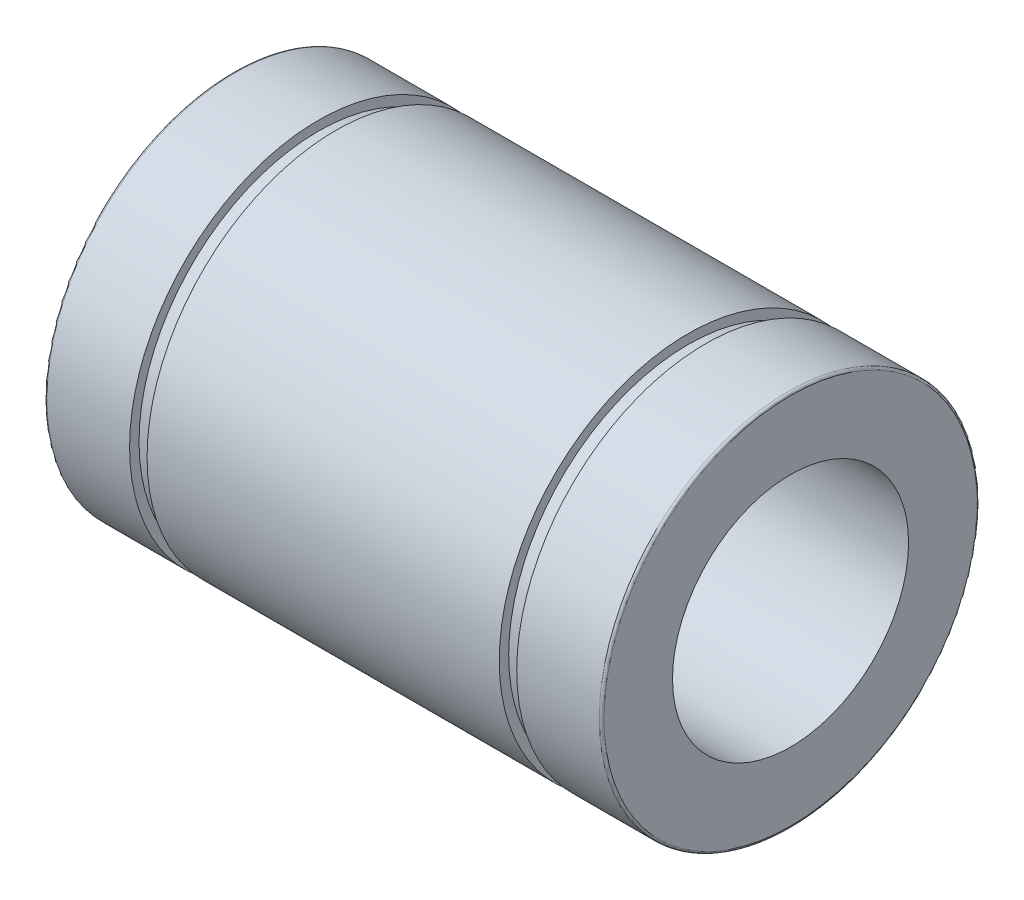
ISO-10303-21;
HEADER;
FILE_DESCRIPTION(('STEP AP214'),'2;1');
FILE_NAME('part.step','',(''),(''),'','','');
FILE_SCHEMA(('AUTOMOTIVE_DESIGN { 1 0 10303 214 1 1 1 1 }'));
ENDSEC;
DATA;
#1=APPLICATION_CONTEXT('core data for automotive mechanical design processes');
#2=APPLICATION_PROTOCOL_DEFINITION('international standard','automotive_design',2000,#1);
#3=PRODUCT_CONTEXT('',#1,'mechanical');
#4=PRODUCT('Part','Part','',(#3));
#5=PRODUCT_RELATED_PRODUCT_CATEGORY('part','',(#4));
#6=PRODUCT_DEFINITION_FORMATION('','',#4);
#7=PRODUCT_DEFINITION_CONTEXT('part definition',#1,'design');
#8=PRODUCT_DEFINITION('design','',#6,#7);
#9=PRODUCT_DEFINITION_SHAPE('','',#8);
#10=(LENGTH_UNIT() NAMED_UNIT(*) SI_UNIT(.MILLI.,.METRE.));
#11=(NAMED_UNIT(*) PLANE_ANGLE_UNIT() SI_UNIT($,.RADIAN.));
#12=(NAMED_UNIT(*) SI_UNIT($,.STERADIAN.) SOLID_ANGLE_UNIT());
#13=UNCERTAINTY_MEASURE_WITH_UNIT(LENGTH_MEASURE(1.E-05),#10,'distance_accuracy_value','');
#14=(GEOMETRIC_REPRESENTATION_CONTEXT(3) GLOBAL_UNCERTAINTY_ASSIGNED_CONTEXT((#13)) GLOBAL_UNIT_ASSIGNED_CONTEXT((#10,
#11,#12)) REPRESENTATION_CONTEXT('',''));
#15=CARTESIAN_POINT('',(0.,0.,0.));
#16=DIRECTION('',(0.,0.,1.));
#17=DIRECTION('',(1.,0.,0.));
#18=AXIS2_PLACEMENT_3D('',#15,#16,#17);
#19=CARTESIAN_POINT('',(-29.25,0.,0.));
#20=DIRECTION('',(1.,0.,0.));
#21=DIRECTION('',(0.,0.,-1.));
#22=AXIS2_PLACEMENT_3D('',#19,#20,#21);
#23=TOROIDAL_SURFACE('',#22,19.75,0.25);
#24=CARTESIAN_POINT('',(-29.25,0.,0.));
#25=DIRECTION('',(1.,0.,0.));
#26=DIRECTION('',(0.,0.,-1.));
#27=AXIS2_PLACEMENT_3D('',#24,#25,#26);
#28=CIRCLE('',#27,20.);
#29=CARTESIAN_POINT('',(-29.25,0.,-20.));
#30=VERTEX_POINT('',#29);
#31=CARTESIAN_POINT('',(-29.25,0.,20.));
#32=VERTEX_POINT('',#31);
#33=EDGE_CURVE('E250',#30,#32,#28,.T.);
#34=ORIENTED_EDGE('',*,*,#33,.F.);
#35=CARTESIAN_POINT('',(-29.25,0.,0.));
#36=DIRECTION('',(1.,0.,0.));
#37=DIRECTION('',(0.,0.,-1.));
#38=AXIS2_PLACEMENT_3D('',#35,#36,#37);
#39=CIRCLE('',#38,20.);
#40=EDGE_CURVE('E252',#32,#30,#39,.T.);
#41=ORIENTED_EDGE('',*,*,#40,.F.);
#42=CARTESIAN_POINT('',(-29.25,0.,19.75));
#43=DIRECTION('',(0.,-1.,0.));
#44=DIRECTION('',(0.,0.,1.));
#45=AXIS2_PLACEMENT_3D('',#42,#43,#44);
#46=CIRCLE('',#45,0.25);
#47=CARTESIAN_POINT('',(-29.5,0.,19.75));
#48=VERTEX_POINT('',#47);
#49=EDGE_CURVE('E10',#32,#48,#46,.T.);
#50=ORIENTED_EDGE('',*,*,#49,.T.);
#51=CARTESIAN_POINT('',(-29.5,0.,0.));
#52=DIRECTION('',(-1.,0.,0.));
#53=DIRECTION('',(0.,0.,-1.));
#54=AXIS2_PLACEMENT_3D('',#51,#52,#53);
#55=CIRCLE('',#54,19.75);
#56=CARTESIAN_POINT('',(-29.5,0.,-19.75));
#57=VERTEX_POINT('',#56);
#58=EDGE_CURVE('E213',#57,#48,#55,.T.);
#59=ORIENTED_EDGE('',*,*,#58,.F.);
#60=CARTESIAN_POINT('',(-29.5,0.,0.));
#61=DIRECTION('',(-1.,0.,0.));
#62=DIRECTION('',(0.,0.,-1.));
#63=AXIS2_PLACEMENT_3D('',#60,#61,#62);
#64=CIRCLE('',#63,19.75);
#65=EDGE_CURVE('E42',#48,#57,#64,.T.);
#66=ORIENTED_EDGE('',*,*,#65,.F.);
#67=ORIENTED_EDGE('',*,*,#49,.F.);
#68=EDGE_LOOP('',(#34,#41,#50,#59,#66,#67));
#69=FACE_BOUND('',#68,.T.);
#70=ADVANCED_FACE('F16',(#69),#23,.T.);
#71=CARTESIAN_POINT('',(29.25,0.,0.));
#72=DIRECTION('',(-1.,0.,0.));
#73=DIRECTION('',(0.,0.,1.));
#74=AXIS2_PLACEMENT_3D('',#71,#72,#73);
#75=TOROIDAL_SURFACE('',#74,19.75,0.25);
#76=CARTESIAN_POINT('',(29.25,0.,0.));
#77=DIRECTION('',(-1.,0.,0.));
#78=DIRECTION('',(0.,0.,1.));
#79=AXIS2_PLACEMENT_3D('',#76,#77,#78);
#80=CIRCLE('',#79,20.);
#81=CARTESIAN_POINT('',(29.25,0.,20.));
#82=VERTEX_POINT('',#81);
#83=CARTESIAN_POINT('',(29.25,0.,-20.));
#84=VERTEX_POINT('',#83);
#85=EDGE_CURVE('E197',#82,#84,#80,.T.);
#86=ORIENTED_EDGE('',*,*,#85,.F.);
#87=CARTESIAN_POINT('',(29.25,0.,0.));
#88=DIRECTION('',(-1.,0.,0.));
#89=DIRECTION('',(0.,0.,1.));
#90=AXIS2_PLACEMENT_3D('',#87,#88,#89);
#91=CIRCLE('',#90,20.);
#92=EDGE_CURVE('E193',#84,#82,#91,.T.);
#93=ORIENTED_EDGE('',*,*,#92,.F.);
#94=CARTESIAN_POINT('',(29.25,0.,-19.75));
#95=DIRECTION('',(0.,-1.,0.));
#96=DIRECTION('',(0.,0.,-1.));
#97=AXIS2_PLACEMENT_3D('',#94,#95,#96);
#98=CIRCLE('',#97,0.25);
#99=CARTESIAN_POINT('',(29.5,0.,-19.75));
#100=VERTEX_POINT('',#99);
#101=EDGE_CURVE('E24',#84,#100,#98,.T.);
#102=ORIENTED_EDGE('',*,*,#101,.T.);
#103=CARTESIAN_POINT('',(29.5,0.,0.));
#104=DIRECTION('',(1.,0.,0.));
#105=DIRECTION('',(0.,0.,1.));
#106=AXIS2_PLACEMENT_3D('',#103,#104,#105);
#107=CIRCLE('',#106,19.75);
#108=CARTESIAN_POINT('',(29.5,0.,19.75));
#109=VERTEX_POINT('',#108);
#110=EDGE_CURVE('E176',#109,#100,#107,.T.);
#111=ORIENTED_EDGE('',*,*,#110,.F.);
#112=CARTESIAN_POINT('',(29.5,0.,0.));
#113=DIRECTION('',(1.,0.,0.));
#114=DIRECTION('',(0.,0.,1.));
#115=AXIS2_PLACEMENT_3D('',#112,#113,#114);
#116=CIRCLE('',#115,19.75);
#117=EDGE_CURVE('E172',#100,#109,#116,.T.);
#118=ORIENTED_EDGE('',*,*,#117,.F.);
#119=ORIENTED_EDGE('',*,*,#101,.F.);
#120=EDGE_LOOP('',(#86,#93,#102,#111,#118,#119));
#121=FACE_BOUND('',#120,.T.);
#122=ADVANCED_FACE('F224',(#121),#75,.T.);
#123=CARTESIAN_POINT('',(-29.5,12.5,0.));
#124=DIRECTION('',(1.,0.,0.));
#125=DIRECTION('',(0.,1.,0.));
#126=AXIS2_PLACEMENT_3D('',#123,#124,#125);
#127=PLANE('',#126);
#128=CARTESIAN_POINT('',(-29.5,0.,0.));
#129=DIRECTION('',(-1.,0.,0.));
#130=DIRECTION('',(0.,0.,1.));
#131=AXIS2_PLACEMENT_3D('',#128,#129,#130);
#132=CIRCLE('',#131,12.5);
#133=CARTESIAN_POINT('',(-29.5,0.,12.5));
#134=VERTEX_POINT('',#133);
#135=CARTESIAN_POINT('',(-29.5,0.,-12.5));
#136=VERTEX_POINT('',#135);
#137=EDGE_CURVE('E212',#134,#136,#132,.T.);
#138=ORIENTED_EDGE('',*,*,#137,.F.);
#139=CARTESIAN_POINT('',(-29.5,0.,0.));
#140=DIRECTION('',(-1.,0.,0.));
#141=DIRECTION('',(0.,0.,1.));
#142=AXIS2_PLACEMENT_3D('',#139,#140,#141);
#143=CIRCLE('',#142,12.5);
#144=EDGE_CURVE('E185',#136,#134,#143,.T.);
#145=ORIENTED_EDGE('',*,*,#144,.F.);
#146=EDGE_LOOP('',(#138,#145));
#147=FACE_BOUND('',#146,.T.);
#148=ORIENTED_EDGE('',*,*,#58,.T.);
#149=ORIENTED_EDGE('',*,*,#65,.T.);
#150=EDGE_LOOP('',(#148,#149));
#151=FACE_BOUND('',#150,.T.);
#152=ADVANCED_FACE('F239',(#147,#151),#127,.F.);
#153=CARTESIAN_POINT('',(-70.8336887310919,0.,0.));
#154=DIRECTION('',(-1.,0.,0.));
#155=DIRECTION('',(0.,0.,1.));
#156=AXIS2_PLACEMENT_3D('',#153,#154,#155);
#157=CYLINDRICAL_SURFACE('',#156,12.5);
#158=CARTESIAN_POINT('',(29.5,0.,0.));
#159=DIRECTION('',(-1.,0.,0.));
#160=DIRECTION('',(0.,0.,1.));
#161=AXIS2_PLACEMENT_3D('',#158,#159,#160);
#162=CIRCLE('',#161,12.5);
#163=CARTESIAN_POINT('',(29.5,0.,12.5));
#164=VERTEX_POINT('',#163);
#165=CARTESIAN_POINT('',(29.5,0.,-12.5));
#166=VERTEX_POINT('',#165);
#167=EDGE_CURVE('E175',#164,#166,#162,.T.);
#168=ORIENTED_EDGE('',*,*,#167,.F.);
#169=CARTESIAN_POINT('',(29.5,0.,0.));
#170=DIRECTION('',(-1.,0.,0.));
#171=DIRECTION('',(0.,0.,1.));
#172=AXIS2_PLACEMENT_3D('',#169,#170,#171);
#173=CIRCLE('',#172,12.5);
#174=EDGE_CURVE('E186',#166,#164,#173,.T.);
#175=ORIENTED_EDGE('',*,*,#174,.F.);
#176=DIRECTION('',(-1.,0.,0.));
#177=VECTOR('',#176,1.);
#178=CARTESIAN_POINT('',(-70.8336887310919,0.,-12.5));
#179=LINE('',#178,#177);
#180=EDGE_CURVE('E181',#166,#136,#179,.T.);
#181=ORIENTED_EDGE('',*,*,#180,.T.);
#182=ORIENTED_EDGE('',*,*,#144,.T.);
#183=ORIENTED_EDGE('',*,*,#137,.T.);
#184=ORIENTED_EDGE('',*,*,#180,.F.);
#185=EDGE_LOOP('',(#168,#175,#181,#182,#183,#184));
#186=FACE_BOUND('',#185,.T.);
#187=ADVANCED_FACE('F229',(#186),#157,.F.);
#188=CARTESIAN_POINT('',(29.5,20.,0.));
#189=DIRECTION('',(-1.,0.,0.));
#190=DIRECTION('',(0.,0.,1.));
#191=AXIS2_PLACEMENT_3D('',#188,#189,#190);
#192=PLANE('',#191);
#193=ORIENTED_EDGE('',*,*,#167,.T.);
#194=ORIENTED_EDGE('',*,*,#174,.T.);
#195=EDGE_LOOP('',(#193,#194));
#196=FACE_BOUND('',#195,.T.);
#197=ORIENTED_EDGE('',*,*,#110,.T.);
#198=ORIENTED_EDGE('',*,*,#117,.T.);
#199=EDGE_LOOP('',(#197,#198));
#200=FACE_BOUND('',#199,.T.);
#201=ADVANCED_FACE('F226',(#196,#200),#192,.F.);
#202=CARTESIAN_POINT('',(-70.8336887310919,0.,0.));
#203=DIRECTION('',(-1.,0.,0.));
#204=DIRECTION('',(0.,0.,1.));
#205=AXIS2_PLACEMENT_3D('',#202,#203,#204);
#206=CYLINDRICAL_SURFACE('',#205,20.);
#207=CARTESIAN_POINT('',(20.5,0.,0.));
#208=DIRECTION('',(-1.,0.,0.));
#209=DIRECTION('',(0.,0.,1.));
#210=AXIS2_PLACEMENT_3D('',#207,#208,#209);
#211=CIRCLE('',#210,20.);
#212=CARTESIAN_POINT('',(20.5,0.,20.));
#213=VERTEX_POINT('',#212);
#214=CARTESIAN_POINT('',(20.5,0.,-20.));
#215=VERTEX_POINT('',#214);
#216=EDGE_CURVE('E156',#213,#215,#211,.T.);
#217=ORIENTED_EDGE('',*,*,#216,.F.);
#218=CARTESIAN_POINT('',(20.5,0.,0.));
#219=DIRECTION('',(-1.,0.,0.));
#220=DIRECTION('',(0.,0.,1.));
#221=AXIS2_PLACEMENT_3D('',#218,#219,#220);
#222=CIRCLE('',#221,20.);
#223=EDGE_CURVE('E180',#215,#213,#222,.T.);
#224=ORIENTED_EDGE('',*,*,#223,.F.);
#225=DIRECTION('',(1.,0.,0.));
#226=VECTOR('',#225,1.);
#227=CARTESIAN_POINT('',(-70.8336887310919,0.,-20.));
#228=LINE('',#227,#226);
#229=EDGE_CURVE('E189',#215,#84,#228,.T.);
#230=ORIENTED_EDGE('',*,*,#229,.T.);
#231=ORIENTED_EDGE('',*,*,#92,.T.);
#232=ORIENTED_EDGE('',*,*,#85,.T.);
#233=ORIENTED_EDGE('',*,*,#229,.F.);
#234=EDGE_LOOP('',(#217,#224,#230,#231,#232,#233));
#235=FACE_BOUND('',#234,.T.);
#236=ADVANCED_FACE('F228',(#235),#206,.T.);
#237=CARTESIAN_POINT('',(20.5,19.,0.));
#238=DIRECTION('',(1.,0.,0.));
#239=DIRECTION('',(0.,1.,0.));
#240=AXIS2_PLACEMENT_3D('',#237,#238,#239);
#241=PLANE('',#240);
#242=CARTESIAN_POINT('',(20.5,0.,0.));
#243=DIRECTION('',(-1.,0.,0.));
#244=DIRECTION('',(0.,0.,1.));
#245=AXIS2_PLACEMENT_3D('',#242,#243,#244);
#246=CIRCLE('',#245,19.);
#247=CARTESIAN_POINT('',(20.5,0.,19.));
#248=VERTEX_POINT('',#247);
#249=CARTESIAN_POINT('',(20.5,0.,-19.));
#250=VERTEX_POINT('',#249);
#251=EDGE_CURVE('E148',#248,#250,#246,.T.);
#252=ORIENTED_EDGE('',*,*,#251,.F.);
#253=CARTESIAN_POINT('',(20.5,0.,0.));
#254=DIRECTION('',(-1.,0.,0.));
#255=DIRECTION('',(0.,0.,1.));
#256=AXIS2_PLACEMENT_3D('',#253,#254,#255);
#257=CIRCLE('',#256,19.);
#258=EDGE_CURVE('E152',#250,#248,#257,.T.);
#259=ORIENTED_EDGE('',*,*,#258,.F.);
#260=EDGE_LOOP('',(#252,#259));
#261=FACE_BOUND('',#260,.T.);
#262=ORIENTED_EDGE('',*,*,#216,.T.);
#263=ORIENTED_EDGE('',*,*,#223,.T.);
#264=EDGE_LOOP('',(#262,#263));
#265=FACE_BOUND('',#264,.T.);
#266=ADVANCED_FACE('F150',(#261,#265),#241,.F.);
#267=CARTESIAN_POINT('',(-70.8336887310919,0.,0.));
#268=DIRECTION('',(-1.,0.,0.));
#269=DIRECTION('',(0.,0.,1.));
#270=AXIS2_PLACEMENT_3D('',#267,#268,#269);
#271=CYLINDRICAL_SURFACE('',#270,19.);
#272=CARTESIAN_POINT('',(18.65,0.,0.));
#273=DIRECTION('',(-1.,0.,0.));
#274=DIRECTION('',(0.,0.,1.));
#275=AXIS2_PLACEMENT_3D('',#272,#273,#274);
#276=CIRCLE('',#275,19.);
#277=CARTESIAN_POINT('',(18.65,0.,19.));
#278=VERTEX_POINT('',#277);
#279=CARTESIAN_POINT('',(18.65,0.,-19.));
#280=VERTEX_POINT('',#279);
#281=EDGE_CURVE('E267',#278,#280,#276,.T.);
#282=ORIENTED_EDGE('',*,*,#281,.F.);
#283=CARTESIAN_POINT('',(18.65,0.,0.));
#284=DIRECTION('',(-1.,0.,0.));
#285=DIRECTION('',(0.,0.,1.));
#286=AXIS2_PLACEMENT_3D('',#283,#284,#285);
#287=CIRCLE('',#286,19.);
#288=EDGE_CURVE('E168',#280,#278,#287,.T.);
#289=ORIENTED_EDGE('',*,*,#288,.F.);
#290=DIRECTION('',(1.,0.,0.));
#291=VECTOR('',#290,1.);
#292=CARTESIAN_POINT('',(-70.8336887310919,0.,-19.));
#293=LINE('',#292,#291);
#294=EDGE_CURVE('E161',#280,#250,#293,.T.);
#295=ORIENTED_EDGE('',*,*,#294,.T.);
#296=ORIENTED_EDGE('',*,*,#258,.T.);
#297=ORIENTED_EDGE('',*,*,#251,.T.);
#298=ORIENTED_EDGE('',*,*,#294,.F.);
#299=EDGE_LOOP('',(#282,#289,#295,#296,#297,#298));
#300=FACE_BOUND('',#299,.T.);
#301=ADVANCED_FACE('F159',(#300),#271,.T.);
#302=CARTESIAN_POINT('',(18.65,20.,0.));
#303=DIRECTION('',(-1.,0.,0.));
#304=DIRECTION('',(0.,0.,1.));
#305=AXIS2_PLACEMENT_3D('',#302,#303,#304);
#306=PLANE('',#305);
#307=ORIENTED_EDGE('',*,*,#281,.T.);
#308=ORIENTED_EDGE('',*,*,#288,.T.);
#309=EDGE_LOOP('',(#307,#308));
#310=FACE_BOUND('',#309,.T.);
#311=CARTESIAN_POINT('',(18.65,0.,0.));
#312=DIRECTION('',(-1.,0.,0.));
#313=DIRECTION('',(0.,0.,1.));
#314=AXIS2_PLACEMENT_3D('',#311,#312,#313);
#315=CIRCLE('',#314,20.);
#316=CARTESIAN_POINT('',(18.65,0.,20.));
#317=VERTEX_POINT('',#316);
#318=CARTESIAN_POINT('',(18.65,0.,-20.));
#319=VERTEX_POINT('',#318);
#320=EDGE_CURVE('E270',#317,#319,#315,.T.);
#321=ORIENTED_EDGE('',*,*,#320,.F.);
#322=CARTESIAN_POINT('',(18.65,0.,0.));
#323=DIRECTION('',(-1.,0.,0.));
#324=DIRECTION('',(0.,0.,1.));
#325=AXIS2_PLACEMENT_3D('',#322,#323,#324);
#326=CIRCLE('',#325,20.);
#327=EDGE_CURVE('E308',#319,#317,#326,.T.);
#328=ORIENTED_EDGE('',*,*,#327,.F.);
#329=EDGE_LOOP('',(#321,#328));
#330=FACE_BOUND('',#329,.T.);
#331=ADVANCED_FACE('F317',(#310,#330),#306,.F.);
#332=CARTESIAN_POINT('',(-70.8336887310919,0.,0.));
#333=DIRECTION('',(-1.,0.,0.));
#334=DIRECTION('',(0.,0.,1.));
#335=AXIS2_PLACEMENT_3D('',#332,#333,#334);
#336=CYLINDRICAL_SURFACE('',#335,20.);
#337=CARTESIAN_POINT('',(-18.65,0.,0.));
#338=DIRECTION('',(-1.,0.,0.));
#339=DIRECTION('',(0.,0.,1.));
#340=AXIS2_PLACEMENT_3D('',#337,#338,#339);
#341=CIRCLE('',#340,20.);
#342=CARTESIAN_POINT('',(-18.65,0.,20.));
#343=VERTEX_POINT('',#342);
#344=CARTESIAN_POINT('',(-18.65,0.,-20.));
#345=VERTEX_POINT('',#344);
#346=EDGE_CURVE('E276',#343,#345,#341,.T.);
#347=ORIENTED_EDGE('',*,*,#346,.F.);
#348=CARTESIAN_POINT('',(-18.65,0.,0.));
#349=DIRECTION('',(-1.,0.,0.));
#350=DIRECTION('',(0.,0.,1.));
#351=AXIS2_PLACEMENT_3D('',#348,#349,#350);
#352=CIRCLE('',#351,20.);
#353=EDGE_CURVE('E272',#345,#343,#352,.T.);
#354=ORIENTED_EDGE('',*,*,#353,.F.);
#355=DIRECTION('',(1.,0.,0.));
#356=VECTOR('',#355,1.);
#357=CARTESIAN_POINT('',(-70.8336887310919,0.,-20.));
#358=LINE('',#357,#356);
#359=EDGE_CURVE('E275',#345,#319,#358,.T.);
#360=ORIENTED_EDGE('',*,*,#359,.T.);
#361=ORIENTED_EDGE('',*,*,#327,.T.);
#362=ORIENTED_EDGE('',*,*,#320,.T.);
#363=ORIENTED_EDGE('',*,*,#359,.F.);
#364=EDGE_LOOP('',(#347,#354,#360,#361,#362,#363));
#365=FACE_BOUND('',#364,.T.);
#366=ADVANCED_FACE('F320',(#365),#336,.T.);
#367=CARTESIAN_POINT('',(-18.65,19.,0.));
#368=DIRECTION('',(1.,0.,0.));
#369=DIRECTION('',(0.,1.,0.));
#370=AXIS2_PLACEMENT_3D('',#367,#368,#369);
#371=PLANE('',#370);
#372=CARTESIAN_POINT('',(-18.65,0.,0.));
#373=DIRECTION('',(-1.,0.,0.));
#374=DIRECTION('',(0.,0.,1.));
#375=AXIS2_PLACEMENT_3D('',#372,#373,#374);
#376=CIRCLE('',#375,19.);
#377=CARTESIAN_POINT('',(-18.65,0.,19.));
#378=VERTEX_POINT('',#377);
#379=CARTESIAN_POINT('',(-18.65,0.,-19.));
#380=VERTEX_POINT('',#379);
#381=EDGE_CURVE('E277',#378,#380,#376,.T.);
#382=ORIENTED_EDGE('',*,*,#381,.F.);
#383=CARTESIAN_POINT('',(-18.65,0.,0.));
#384=DIRECTION('',(-1.,0.,0.));
#385=DIRECTION('',(0.,0.,1.));
#386=AXIS2_PLACEMENT_3D('',#383,#384,#385);
#387=CIRCLE('',#386,19.);
#388=EDGE_CURVE('E280',#380,#378,#387,.T.);
#389=ORIENTED_EDGE('',*,*,#388,.F.);
#390=EDGE_LOOP('',(#382,#389));
#391=FACE_BOUND('',#390,.T.);
#392=ORIENTED_EDGE('',*,*,#346,.T.);
#393=ORIENTED_EDGE('',*,*,#353,.T.);
#394=EDGE_LOOP('',(#392,#393));
#395=FACE_BOUND('',#394,.T.);
#396=ADVANCED_FACE('F327',(#391,#395),#371,.F.);
#397=CARTESIAN_POINT('',(-70.8336887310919,0.,0.));
#398=DIRECTION('',(-1.,0.,0.));
#399=DIRECTION('',(0.,0.,1.));
#400=AXIS2_PLACEMENT_3D('',#397,#398,#399);
#401=CYLINDRICAL_SURFACE('',#400,19.);
#402=CARTESIAN_POINT('',(-20.5,0.,0.));
#403=DIRECTION('',(-1.,0.,0.));
#404=DIRECTION('',(0.,0.,1.));
#405=AXIS2_PLACEMENT_3D('',#402,#403,#404);
#406=CIRCLE('',#405,19.);
#407=CARTESIAN_POINT('',(-20.5,0.,19.));
#408=VERTEX_POINT('',#407);
#409=CARTESIAN_POINT('',(-20.5,0.,-19.));
#410=VERTEX_POINT('',#409);
#411=EDGE_CURVE('E287',#408,#410,#406,.T.);
#412=ORIENTED_EDGE('',*,*,#411,.F.);
#413=CARTESIAN_POINT('',(-20.5,0.,0.));
#414=DIRECTION('',(-1.,0.,0.));
#415=DIRECTION('',(0.,0.,1.));
#416=AXIS2_PLACEMENT_3D('',#413,#414,#415);
#417=CIRCLE('',#416,19.);
#418=EDGE_CURVE('E292',#410,#408,#417,.T.);
#419=ORIENTED_EDGE('',*,*,#418,.F.);
#420=DIRECTION('',(1.,0.,0.));
#421=VECTOR('',#420,1.);
#422=CARTESIAN_POINT('',(-70.8336887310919,0.,-19.));
#423=LINE('',#422,#421);
#424=EDGE_CURVE('E295',#410,#380,#423,.T.);
#425=ORIENTED_EDGE('',*,*,#424,.T.);
#426=ORIENTED_EDGE('',*,*,#388,.T.);
#427=ORIENTED_EDGE('',*,*,#381,.T.);
#428=ORIENTED_EDGE('',*,*,#424,.F.);
#429=EDGE_LOOP('',(#412,#419,#425,#426,#427,#428));
#430=FACE_BOUND('',#429,.T.);
#431=ADVANCED_FACE('F329',(#430),#401,.T.);
#432=CARTESIAN_POINT('',(-20.5,20.,0.));
#433=DIRECTION('',(-1.,0.,0.));
#434=DIRECTION('',(0.,0.,1.));
#435=AXIS2_PLACEMENT_3D('',#432,#433,#434);
#436=PLANE('',#435);
#437=ORIENTED_EDGE('',*,*,#411,.T.);
#438=ORIENTED_EDGE('',*,*,#418,.T.);
#439=EDGE_LOOP('',(#437,#438));
#440=FACE_BOUND('',#439,.T.);
#441=CARTESIAN_POINT('',(-20.5,0.,0.));
#442=DIRECTION('',(-1.,0.,0.));
#443=DIRECTION('',(0.,0.,1.));
#444=AXIS2_PLACEMENT_3D('',#441,#442,#443);
#445=CIRCLE('',#444,20.);
#446=CARTESIAN_POINT('',(-20.5,0.,20.));
#447=VERTEX_POINT('',#446);
#448=CARTESIAN_POINT('',(-20.5,0.,-20.));
#449=VERTEX_POINT('',#448);
#450=EDGE_CURVE('E266',#447,#449,#445,.T.);
#451=ORIENTED_EDGE('',*,*,#450,.F.);
#452=CARTESIAN_POINT('',(-20.5,0.,0.));
#453=DIRECTION('',(-1.,0.,0.));
#454=DIRECTION('',(0.,0.,1.));
#455=AXIS2_PLACEMENT_3D('',#452,#453,#454);
#456=CIRCLE('',#455,20.);
#457=EDGE_CURVE('E262',#449,#447,#456,.T.);
#458=ORIENTED_EDGE('',*,*,#457,.F.);
#459=EDGE_LOOP('',(#451,#458));
#460=FACE_BOUND('',#459,.T.);
#461=ADVANCED_FACE('F336',(#440,#460),#436,.F.);
#462=CARTESIAN_POINT('',(-70.8336887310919,0.,0.));
#463=DIRECTION('',(-1.,0.,0.));
#464=DIRECTION('',(0.,0.,1.));
#465=AXIS2_PLACEMENT_3D('',#462,#463,#464);
#466=CYLINDRICAL_SURFACE('',#465,20.);
#467=ORIENTED_EDGE('',*,*,#33,.T.);
#468=ORIENTED_EDGE('',*,*,#40,.T.);
#469=DIRECTION('',(1.,0.,0.));
#470=VECTOR('',#469,1.);
#471=CARTESIAN_POINT('',(-70.8336887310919,0.,-20.));
#472=LINE('',#471,#470);
#473=EDGE_CURVE('E259',#30,#449,#472,.T.);
#474=ORIENTED_EDGE('',*,*,#473,.T.);
#475=ORIENTED_EDGE('',*,*,#457,.T.);
#476=ORIENTED_EDGE('',*,*,#450,.T.);
#477=ORIENTED_EDGE('',*,*,#473,.F.);
#478=EDGE_LOOP('',(#467,#468,#474,#475,#476,#477));
#479=FACE_BOUND('',#478,.T.);
#480=ADVANCED_FACE('F426',(#479),#466,.T.);
#481=CLOSED_SHELL('',(#70,#122,#152,#187,#201,#236,#266,#301,#331,#366,#396,#431,#461,#480));
#482=MANIFOLD_SOLID_BREP('B1',#481);
#483=ADVANCED_BREP_SHAPE_REPRESENTATION('',(#18,#482),#14);
#484=SHAPE_DEFINITION_REPRESENTATION(#9,#483);
ENDSEC;
END-ISO-10303-21;
